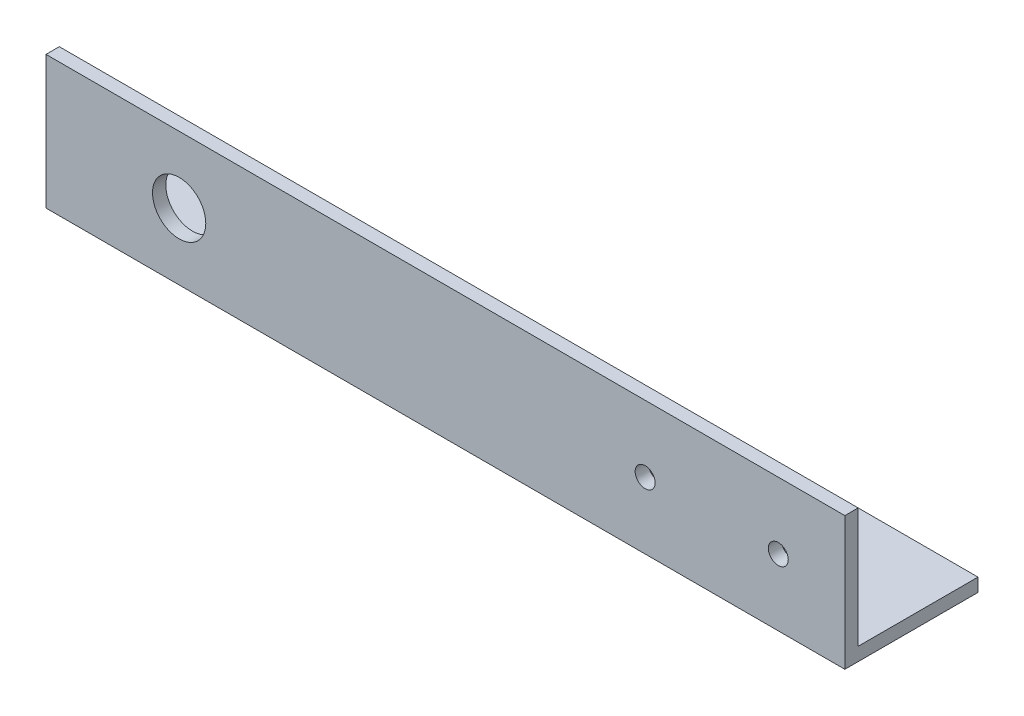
from build123d import *

# Parameters (mm, degrees)
EXTRUDE_1_DEPTH     = 120
SKETCH_2_R          = 4
CUT_EXTRUDE_2_DEPTH = 124.288280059
SKETCH_3_R          = 1.5
CUT_EXTRUDE_3_DEPTH = 124.288280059
SKETCH_4_R          = 1.5
CUT_EXTRUDE_4_DEPTH = 124.288280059


with BuildPart() as part:
    # Sketch 1 → Extrude 1 (new body)
    with BuildSketch(Plane(origin=(0, 0, 0), x_dir=(0, 0, -1), z_dir=(1, 0, 0))):
        Polygon((0, 0), (0, 20), (2, 20), (2, 2), (20, 2), (20, 0), align=None)
    extrude(amount=EXTRUDE_1_DEPTH)

    # Sketch 2 → Cut-Extrude 2 (cut, through all)
    with BuildSketch(Plane.XY):
        with Locations((20, 10)):
            Circle(SKETCH_2_R)
    extrude(amount=-CUT_EXTRUDE_2_DEPTH, mode=Mode.SUBTRACT)

    # Sketch 3 → Cut-Extrude 3 (cut, through all)
    with BuildSketch(Plane.XY):
        with Locations((90, 10)):
            Circle(SKETCH_3_R)
    extrude(amount=-CUT_EXTRUDE_3_DEPTH, mode=Mode.SUBTRACT)

    # Sketch 4 → Cut-Extrude 4 (cut, through all)
    with BuildSketch(Plane.XY):
        with Locations((110, 10)):
            Circle(SKETCH_4_R)
    extrude(amount=-CUT_EXTRUDE_4_DEPTH, mode=Mode.SUBTRACT)


solid = part.part
